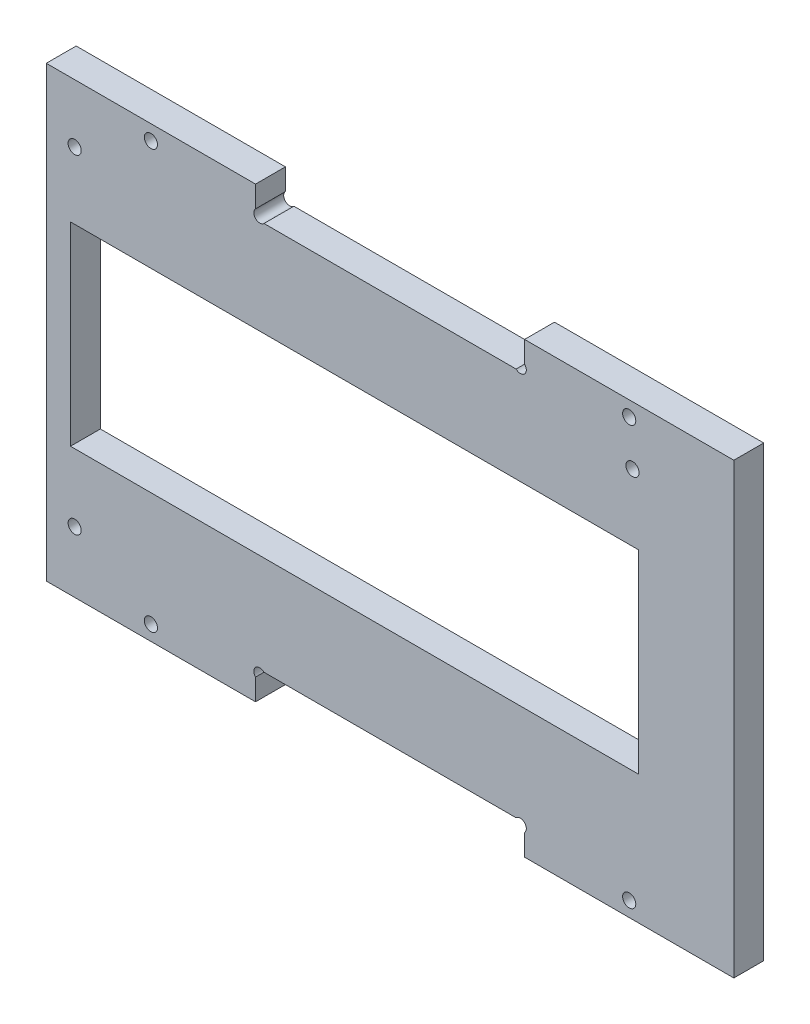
ISO-10303-21;
HEADER;
FILE_DESCRIPTION(('STEP AP214'),'2;1');
FILE_NAME('part.step','',(''),(''),'','','');
FILE_SCHEMA(('AUTOMOTIVE_DESIGN { 1 0 10303 214 1 1 1 1 }'));
ENDSEC;
DATA;
#1=APPLICATION_CONTEXT('core data for automotive mechanical design processes');
#2=APPLICATION_PROTOCOL_DEFINITION('international standard','automotive_design',2000,#1);
#3=PRODUCT_CONTEXT('',#1,'mechanical');
#4=PRODUCT('Part','Part','',(#3));
#5=PRODUCT_RELATED_PRODUCT_CATEGORY('part','',(#4));
#6=PRODUCT_DEFINITION_FORMATION('','',#4);
#7=PRODUCT_DEFINITION_CONTEXT('part definition',#1,'design');
#8=PRODUCT_DEFINITION('design','',#6,#7);
#9=PRODUCT_DEFINITION_SHAPE('','',#8);
#10=(LENGTH_UNIT() NAMED_UNIT(*) SI_UNIT(.MILLI.,.METRE.));
#11=(NAMED_UNIT(*) PLANE_ANGLE_UNIT() SI_UNIT($,.RADIAN.));
#12=(NAMED_UNIT(*) SI_UNIT($,.STERADIAN.) SOLID_ANGLE_UNIT());
#13=UNCERTAINTY_MEASURE_WITH_UNIT(LENGTH_MEASURE(1.E-05),#10,'distance_accuracy_value','');
#14=(GEOMETRIC_REPRESENTATION_CONTEXT(3) GLOBAL_UNCERTAINTY_ASSIGNED_CONTEXT((#13)) GLOBAL_UNIT_ASSIGNED_CONTEXT((#10,
#11,#12)) REPRESENTATION_CONTEXT('',''));
#15=CARTESIAN_POINT('',(0.,0.,0.));
#16=DIRECTION('',(0.,0.,1.));
#17=DIRECTION('',(1.,0.,0.));
#18=AXIS2_PLACEMENT_3D('',#15,#16,#17);
#19=CARTESIAN_POINT('',(0.,75.,5.));
#20=DIRECTION('',(0.,0.,-1.));
#21=DIRECTION('',(-1.,0.,0.));
#22=AXIS2_PLACEMENT_3D('',#19,#20,#21);
#23=PLANE('',#22);
#24=CARTESIAN_POINT('',(17.5,72.5,5.));
#25=DIRECTION('',(0.,0.,-1.));
#26=DIRECTION('',(-1.,0.,0.));
#27=AXIS2_PLACEMENT_3D('',#24,#25,#26);
#28=CIRCLE('',#27,1.10000000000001);
#29=CARTESIAN_POINT('',(16.4,72.5,5.));
#30=VERTEX_POINT('',#29);
#31=EDGE_CURVE('E771',#30,#30,#28,.T.);
#32=ORIENTED_EDGE('',*,*,#31,.T.);
#33=EDGE_LOOP('',(#32));
#34=FACE_BOUND('',#33,.T.);
#35=CARTESIAN_POINT('',(97.5,72.5,5.));
#36=DIRECTION('',(0.,0.,1.));
#37=DIRECTION('',(1.,0.,0.));
#38=AXIS2_PLACEMENT_3D('',#35,#36,#37);
#39=CIRCLE('',#38,1.10000000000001);
#40=CARTESIAN_POINT('',(98.6,72.5,5.));
#41=VERTEX_POINT('',#40);
#42=EDGE_CURVE('E227',#41,#41,#39,.T.);
#43=ORIENTED_EDGE('',*,*,#42,.F.);
#44=EDGE_LOOP('',(#43));
#45=FACE_BOUND('',#44,.T.);
#46=CARTESIAN_POINT('',(4.75,10.25,5.));
#47=DIRECTION('',(0.,0.,1.));
#48=DIRECTION('',(1.,0.,0.));
#49=AXIS2_PLACEMENT_3D('',#46,#47,#48);
#50=CIRCLE('',#49,1.1);
#51=CARTESIAN_POINT('',(5.85,10.25,5.));
#52=VERTEX_POINT('',#51);
#53=EDGE_CURVE('E314',#52,#52,#50,.T.);
#54=ORIENTED_EDGE('',*,*,#53,.F.);
#55=EDGE_LOOP('',(#54));
#56=FACE_BOUND('',#55,.T.);
#57=CARTESIAN_POINT('',(98.05,65.25,5.));
#58=DIRECTION('',(0.,0.,1.));
#59=DIRECTION('',(1.,0.,0.));
#60=AXIS2_PLACEMENT_3D('',#57,#58,#59);
#61=CIRCLE('',#60,1.10000000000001);
#62=CARTESIAN_POINT('',(99.15,65.25,5.));
#63=VERTEX_POINT('',#62);
#64=EDGE_CURVE('E320',#63,#63,#61,.T.);
#65=ORIENTED_EDGE('',*,*,#64,.F.);
#66=EDGE_LOOP('',(#65));
#67=FACE_BOUND('',#66,.T.);
#68=CARTESIAN_POINT('',(4.75,65.25,5.));
#69=DIRECTION('',(0.,0.,1.));
#70=DIRECTION('',(1.,0.,0.));
#71=AXIS2_PLACEMENT_3D('',#68,#69,#70);
#72=CIRCLE('',#71,1.1);
#73=CARTESIAN_POINT('',(5.85,65.25,5.));
#74=VERTEX_POINT('',#73);
#75=EDGE_CURVE('E326',#74,#74,#72,.T.);
#76=ORIENTED_EDGE('',*,*,#75,.F.);
#77=EDGE_LOOP('',(#76));
#78=FACE_BOUND('',#77,.T.);
#79=DIRECTION('',(1.,0.,0.));
#80=VECTOR('',#79,1.);
#81=CARTESIAN_POINT('',(4.05,21.55,5.));
#82=LINE('',#81,#80);
#83=CARTESIAN_POINT('',(4.05,21.55,5.));
#84=VERTEX_POINT('',#83);
#85=CARTESIAN_POINT('',(99.05,21.55,5.));
#86=VERTEX_POINT('',#85);
#87=EDGE_CURVE('E342',#84,#86,#82,.T.);
#88=ORIENTED_EDGE('',*,*,#87,.F.);
#89=DIRECTION('',(0.,-1.,0.));
#90=VECTOR('',#89,1.);
#91=CARTESIAN_POINT('',(4.05,21.55,5.));
#92=LINE('',#91,#90);
#93=CARTESIAN_POINT('',(4.05,54.05,5.));
#94=VERTEX_POINT('',#93);
#95=EDGE_CURVE('E340',#94,#84,#92,.T.);
#96=ORIENTED_EDGE('',*,*,#95,.F.);
#97=DIRECTION('',(-1.,0.,0.));
#98=VECTOR('',#97,1.);
#99=CARTESIAN_POINT('',(4.05,54.05,5.));
#100=LINE('',#99,#98);
#101=CARTESIAN_POINT('',(99.05,54.05,5.));
#102=VERTEX_POINT('',#101);
#103=EDGE_CURVE('E348',#102,#94,#100,.T.);
#104=ORIENTED_EDGE('',*,*,#103,.F.);
#105=DIRECTION('',(0.,1.,0.));
#106=VECTOR('',#105,1.);
#107=CARTESIAN_POINT('',(99.05,21.55,5.));
#108=LINE('',#107,#106);
#109=EDGE_CURVE('E345',#86,#102,#108,.T.);
#110=ORIENTED_EDGE('',*,*,#109,.F.);
#111=EDGE_LOOP('',(#88,#96,#104,#110));
#112=FACE_BOUND('',#111,.T.);
#113=CARTESIAN_POINT('',(79.2928932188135,4.29289321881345,5.));
#114=DIRECTION('',(0.,0.,1.));
#115=DIRECTION('',(1.,0.,0.));
#116=AXIS2_PLACEMENT_3D('',#113,#114,#115);
#117=CIRCLE('',#116,0.999999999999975);
#118=CARTESIAN_POINT('',(80.,3.58578643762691,5.));
#119=VERTEX_POINT('',#118);
#120=CARTESIAN_POINT('',(78.585786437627,5.,5.));
#121=VERTEX_POINT('',#120);
#122=EDGE_CURVE('E250',#119,#121,#117,.T.);
#123=ORIENTED_EDGE('',*,*,#122,.F.);
#124=DIRECTION('',(0.,1.,0.));
#125=VECTOR('',#124,1.);
#126=CARTESIAN_POINT('',(80.,0.,5.));
#127=LINE('',#126,#125);
#128=CARTESIAN_POINT('',(80.,0.,5.));
#129=VERTEX_POINT('',#128);
#130=EDGE_CURVE('E279',#129,#119,#127,.T.);
#131=ORIENTED_EDGE('',*,*,#130,.F.);
#132=DIRECTION('',(1.,0.,0.));
#133=VECTOR('',#132,1.);
#134=CARTESIAN_POINT('',(0.,0.,5.));
#135=LINE('',#134,#133);
#136=CARTESIAN_POINT('',(115.,0.,5.));
#137=VERTEX_POINT('',#136);
#138=EDGE_CURVE('E367',#129,#137,#135,.T.);
#139=ORIENTED_EDGE('',*,*,#138,.T.);
#140=DIRECTION('',(0.,1.,0.));
#141=VECTOR('',#140,1.);
#142=CARTESIAN_POINT('',(115.,0.,5.));
#143=LINE('',#142,#141);
#144=CARTESIAN_POINT('',(115.,75.,5.));
#145=VERTEX_POINT('',#144);
#146=EDGE_CURVE('E372',#137,#145,#143,.T.);
#147=ORIENTED_EDGE('',*,*,#146,.T.);
#148=DIRECTION('',(-1.,0.,0.));
#149=VECTOR('',#148,1.);
#150=CARTESIAN_POINT('',(0.,75.,5.));
#151=LINE('',#150,#149);
#152=CARTESIAN_POINT('',(80.,75.,5.));
#153=VERTEX_POINT('',#152);
#154=EDGE_CURVE('E375',#145,#153,#151,.T.);
#155=ORIENTED_EDGE('',*,*,#154,.T.);
#156=DIRECTION('',(0.,1.,0.));
#157=VECTOR('',#156,1.);
#158=CARTESIAN_POINT('',(80.,75.,5.));
#159=LINE('',#158,#157);
#160=CARTESIAN_POINT('',(80.,71.4142135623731,5.));
#161=VERTEX_POINT('',#160);
#162=EDGE_CURVE('E303',#161,#153,#159,.T.);
#163=ORIENTED_EDGE('',*,*,#162,.F.);
#164=CARTESIAN_POINT('',(79.2928932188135,70.7071067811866,5.));
#165=DIRECTION('',(0.,0.,1.));
#166=DIRECTION('',(1.,0.,0.));
#167=AXIS2_PLACEMENT_3D('',#164,#165,#166);
#168=CIRCLE('',#167,0.999999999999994);
#169=CARTESIAN_POINT('',(78.5857864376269,70.,5.));
#170=VERTEX_POINT('',#169);
#171=EDGE_CURVE('E263',#170,#161,#168,.T.);
#172=ORIENTED_EDGE('',*,*,#171,.F.);
#173=DIRECTION('',(1.,0.,0.));
#174=VECTOR('',#173,1.);
#175=CARTESIAN_POINT('',(35.,70.,5.));
#176=LINE('',#175,#174);
#177=CARTESIAN_POINT('',(36.4142135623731,70.,5.));
#178=VERTEX_POINT('',#177);
#179=EDGE_CURVE('E300',#178,#170,#176,.T.);
#180=ORIENTED_EDGE('',*,*,#179,.F.);
#181=CARTESIAN_POINT('',(35.7071067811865,70.7071067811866,5.));
#182=DIRECTION('',(0.,0.,1.));
#183=DIRECTION('',(1.,0.,0.));
#184=AXIS2_PLACEMENT_3D('',#181,#182,#183);
#185=CIRCLE('',#184,0.999999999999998);
#186=CARTESIAN_POINT('',(35.,71.4142135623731,5.));
#187=VERTEX_POINT('',#186);
#188=EDGE_CURVE('E269',#187,#178,#185,.T.);
#189=ORIENTED_EDGE('',*,*,#188,.F.);
#190=DIRECTION('',(0.,-1.,0.));
#191=VECTOR('',#190,1.);
#192=CARTESIAN_POINT('',(35.,75.,5.));
#193=LINE('',#192,#191);
#194=CARTESIAN_POINT('',(35.,75.,5.));
#195=VERTEX_POINT('',#194);
#196=EDGE_CURVE('E297',#195,#187,#193,.T.);
#197=ORIENTED_EDGE('',*,*,#196,.F.);
#198=CARTESIAN_POINT('',(0.,75.,5.));
#199=VERTEX_POINT('',#198);
#200=EDGE_CURVE('E374',#195,#199,#151,.T.);
#201=ORIENTED_EDGE('',*,*,#200,.T.);
#202=DIRECTION('',(0.,-1.,0.));
#203=VECTOR('',#202,1.);
#204=CARTESIAN_POINT('',(0.,0.,5.));
#205=LINE('',#204,#203);
#206=CARTESIAN_POINT('',(0.,0.,5.));
#207=VERTEX_POINT('',#206);
#208=EDGE_CURVE('E364',#199,#207,#205,.T.);
#209=ORIENTED_EDGE('',*,*,#208,.T.);
#210=CARTESIAN_POINT('',(35.,0.,5.));
#211=VERTEX_POINT('',#210);
#212=EDGE_CURVE('E369',#207,#211,#135,.T.);
#213=ORIENTED_EDGE('',*,*,#212,.T.);
#214=DIRECTION('',(0.,-1.,0.));
#215=VECTOR('',#214,1.);
#216=CARTESIAN_POINT('',(35.,0.,5.));
#217=LINE('',#216,#215);
#218=CARTESIAN_POINT('',(35.,3.58578643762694,5.));
#219=VERTEX_POINT('',#218);
#220=EDGE_CURVE('E284',#219,#211,#217,.T.);
#221=ORIENTED_EDGE('',*,*,#220,.F.);
#222=CARTESIAN_POINT('',(35.7071067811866,4.29289321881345,5.));
#223=DIRECTION('',(0.,0.,1.));
#224=DIRECTION('',(1.,0.,0.));
#225=AXIS2_PLACEMENT_3D('',#222,#223,#224);
#226=CIRCLE('',#225,0.99999999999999);
#227=CARTESIAN_POINT('',(36.4142135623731,5.,5.));
#228=VERTEX_POINT('',#227);
#229=EDGE_CURVE('E257',#228,#219,#226,.T.);
#230=ORIENTED_EDGE('',*,*,#229,.F.);
#231=DIRECTION('',(-1.,0.,0.));
#232=VECTOR('',#231,1.);
#233=CARTESIAN_POINT('',(80.,5.,5.));
#234=LINE('',#233,#232);
#235=EDGE_CURVE('E282',#121,#228,#234,.T.);
#236=ORIENTED_EDGE('',*,*,#235,.F.);
#237=EDGE_LOOP('',(#123,#131,#139,#147,#155,#163,#172,#180,#189,#197,#201,#209,#213,#221,#230,#236));
#238=FACE_BOUND('',#237,.T.);
#239=CARTESIAN_POINT('',(17.5,2.5,5.));
#240=DIRECTION('',(0.,0.,1.));
#241=DIRECTION('',(-1.,0.,0.));
#242=AXIS2_PLACEMENT_3D('',#239,#240,#241);
#243=CIRCLE('',#242,1.10000000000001);
#244=CARTESIAN_POINT('',(16.4,2.5,5.));
#245=VERTEX_POINT('',#244);
#246=EDGE_CURVE('E768',#245,#245,#243,.T.);
#247=ORIENTED_EDGE('',*,*,#246,.F.);
#248=EDGE_LOOP('',(#247));
#249=FACE_BOUND('',#248,.T.);
#250=CARTESIAN_POINT('',(97.5,2.5,5.));
#251=DIRECTION('',(0.,0.,-1.));
#252=DIRECTION('',(1.,0.,0.));
#253=AXIS2_PLACEMENT_3D('',#250,#251,#252);
#254=CIRCLE('',#253,1.10000000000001);
#255=CARTESIAN_POINT('',(98.6,2.5,5.));
#256=VERTEX_POINT('',#255);
#257=EDGE_CURVE('E762',#256,#256,#254,.T.);
#258=ORIENTED_EDGE('',*,*,#257,.T.);
#259=EDGE_LOOP('',(#258));
#260=FACE_BOUND('',#259,.T.);
#261=ADVANCED_FACE('F32',(#34,#45,#56,#67,#78,#112,#238,#249,#260),#23,.F.);
#262=CARTESIAN_POINT('',(0.,75.,0.));
#263=DIRECTION('',(0.,0.,-1.));
#264=DIRECTION('',(-1.,0.,0.));
#265=AXIS2_PLACEMENT_3D('',#262,#263,#264);
#266=PLANE('',#265);
#267=CARTESIAN_POINT('',(17.5,72.5,0.));
#268=DIRECTION('',(0.,0.,-1.));
#269=DIRECTION('',(-1.,0.,0.));
#270=AXIS2_PLACEMENT_3D('',#267,#268,#269);
#271=CIRCLE('',#270,1.10000000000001);
#272=CARTESIAN_POINT('',(16.4,72.5,0.));
#273=VERTEX_POINT('',#272);
#274=EDGE_CURVE('E775',#273,#273,#271,.T.);
#275=ORIENTED_EDGE('',*,*,#274,.F.);
#276=EDGE_LOOP('',(#275));
#277=FACE_BOUND('',#276,.T.);
#278=CARTESIAN_POINT('',(97.5,72.5,0.));
#279=DIRECTION('',(0.,0.,-1.));
#280=DIRECTION('',(-1.,0.,0.));
#281=AXIS2_PLACEMENT_3D('',#278,#279,#280);
#282=CIRCLE('',#281,1.10000000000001);
#283=CARTESIAN_POINT('',(96.4,72.5,0.));
#284=VERTEX_POINT('',#283);
#285=EDGE_CURVE('E220',#284,#284,#282,.F.);
#286=ORIENTED_EDGE('',*,*,#285,.T.);
#287=EDGE_LOOP('',(#286));
#288=FACE_BOUND('',#287,.T.);
#289=DIRECTION('',(0.,-1.,0.));
#290=VECTOR('',#289,1.);
#291=CARTESIAN_POINT('',(93.05,13.5,0.));
#292=LINE('',#291,#290);
#293=CARTESIAN_POINT('',(93.05,13.5,0.));
#294=VERTEX_POINT('',#293);
#295=CARTESIAN_POINT('',(93.05,7.49999999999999,0.));
#296=VERTEX_POINT('',#295);
#297=EDGE_CURVE('E47',#294,#296,#292,.T.);
#298=ORIENTED_EDGE('',*,*,#297,.F.);
#299=DIRECTION('',(1.,0.,0.));
#300=VECTOR('',#299,1.);
#301=CARTESIAN_POINT('',(93.05,13.5,0.));
#302=LINE('',#301,#300);
#303=CARTESIAN_POINT('',(53.05,13.5,0.));
#304=VERTEX_POINT('',#303);
#305=EDGE_CURVE('E214',#304,#294,#302,.T.);
#306=ORIENTED_EDGE('',*,*,#305,.F.);
#307=DIRECTION('',(0.,1.,0.));
#308=VECTOR('',#307,1.);
#309=CARTESIAN_POINT('',(53.05,13.5,0.));
#310=LINE('',#309,#308);
#311=CARTESIAN_POINT('',(53.05,7.5,0.));
#312=VERTEX_POINT('',#311);
#313=EDGE_CURVE('E217',#312,#304,#310,.T.);
#314=ORIENTED_EDGE('',*,*,#313,.F.);
#315=DIRECTION('',(-1.,0.,0.));
#316=VECTOR('',#315,1.);
#317=CARTESIAN_POINT('',(93.05,7.5,0.));
#318=LINE('',#317,#316);
#319=EDGE_CURVE('E226',#296,#312,#318,.T.);
#320=ORIENTED_EDGE('',*,*,#319,.F.);
#321=EDGE_LOOP('',(#298,#306,#314,#320));
#322=FACE_BOUND('',#321,.T.);
#323=DIRECTION('',(0.,1.,0.));
#324=VECTOR('',#323,1.);
#325=CARTESIAN_POINT('',(80.,0.,0.));
#326=LINE('',#325,#324);
#327=CARTESIAN_POINT('',(80.,0.,0.));
#328=VERTEX_POINT('',#327);
#329=CARTESIAN_POINT('',(80.,3.58578643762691,0.));
#330=VERTEX_POINT('',#329);
#331=EDGE_CURVE('E276',#328,#330,#326,.T.);
#332=ORIENTED_EDGE('',*,*,#331,.T.);
#333=CARTESIAN_POINT('',(79.2928932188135,4.29289321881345,0.));
#334=DIRECTION('',(0.,0.,-1.));
#335=DIRECTION('',(-1.,0.,0.));
#336=AXIS2_PLACEMENT_3D('',#333,#334,#335);
#337=CIRCLE('',#336,0.999999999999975);
#338=CARTESIAN_POINT('',(78.585786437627,5.,0.));
#339=VERTEX_POINT('',#338);
#340=EDGE_CURVE('E252',#330,#339,#337,.F.);
#341=ORIENTED_EDGE('',*,*,#340,.T.);
#342=DIRECTION('',(-1.,0.,0.));
#343=VECTOR('',#342,1.);
#344=CARTESIAN_POINT('',(80.,5.,0.));
#345=LINE('',#344,#343);
#346=CARTESIAN_POINT('',(36.4142135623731,5.,0.));
#347=VERTEX_POINT('',#346);
#348=EDGE_CURVE('E55',#339,#347,#345,.T.);
#349=ORIENTED_EDGE('',*,*,#348,.T.);
#350=CARTESIAN_POINT('',(35.7071067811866,4.29289321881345,0.));
#351=DIRECTION('',(0.,0.,-1.));
#352=DIRECTION('',(-1.,0.,0.));
#353=AXIS2_PLACEMENT_3D('',#350,#351,#352);
#354=CIRCLE('',#353,0.99999999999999);
#355=CARTESIAN_POINT('',(35.,3.58578643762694,0.));
#356=VERTEX_POINT('',#355);
#357=EDGE_CURVE('E259',#347,#356,#354,.F.);
#358=ORIENTED_EDGE('',*,*,#357,.T.);
#359=DIRECTION('',(0.,-1.,0.));
#360=VECTOR('',#359,1.);
#361=CARTESIAN_POINT('',(35.,0.,0.));
#362=LINE('',#361,#360);
#363=CARTESIAN_POINT('',(35.,0.,0.));
#364=VERTEX_POINT('',#363);
#365=EDGE_CURVE('E274',#356,#364,#362,.T.);
#366=ORIENTED_EDGE('',*,*,#365,.T.);
#367=DIRECTION('',(1.,0.,0.));
#368=VECTOR('',#367,1.);
#369=CARTESIAN_POINT('',(0.,0.,0.));
#370=LINE('',#369,#368);
#371=CARTESIAN_POINT('',(0.,0.,0.));
#372=VERTEX_POINT('',#371);
#373=EDGE_CURVE('E382',#372,#364,#370,.T.);
#374=ORIENTED_EDGE('',*,*,#373,.F.);
#375=DIRECTION('',(0.,-1.,0.));
#376=VECTOR('',#375,1.);
#377=CARTESIAN_POINT('',(0.,0.,0.));
#378=LINE('',#377,#376);
#379=CARTESIAN_POINT('',(0.,75.,0.));
#380=VERTEX_POINT('',#379);
#381=EDGE_CURVE('E363',#380,#372,#378,.T.);
#382=ORIENTED_EDGE('',*,*,#381,.F.);
#383=DIRECTION('',(-1.,0.,0.));
#384=VECTOR('',#383,1.);
#385=CARTESIAN_POINT('',(0.,75.,0.));
#386=LINE('',#385,#384);
#387=CARTESIAN_POINT('',(35.,75.,0.));
#388=VERTEX_POINT('',#387);
#389=EDGE_CURVE('E387',#388,#380,#386,.T.);
#390=ORIENTED_EDGE('',*,*,#389,.F.);
#391=DIRECTION('',(0.,-1.,0.));
#392=VECTOR('',#391,1.);
#393=CARTESIAN_POINT('',(35.,75.,0.));
#394=LINE('',#393,#392);
#395=CARTESIAN_POINT('',(35.,71.4142135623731,0.));
#396=VERTEX_POINT('',#395);
#397=EDGE_CURVE('E294',#388,#396,#394,.T.);
#398=ORIENTED_EDGE('',*,*,#397,.T.);
#399=CARTESIAN_POINT('',(35.7071067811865,70.7071067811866,0.));
#400=DIRECTION('',(0.,0.,-1.));
#401=DIRECTION('',(-1.,0.,0.));
#402=AXIS2_PLACEMENT_3D('',#399,#400,#401);
#403=CIRCLE('',#402,0.999999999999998);
#404=CARTESIAN_POINT('',(36.4142135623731,70.,0.));
#405=VERTEX_POINT('',#404);
#406=EDGE_CURVE('E271',#396,#405,#403,.F.);
#407=ORIENTED_EDGE('',*,*,#406,.T.);
#408=DIRECTION('',(1.,0.,0.));
#409=VECTOR('',#408,1.);
#410=CARTESIAN_POINT('',(35.,70.,0.));
#411=LINE('',#410,#409);
#412=CARTESIAN_POINT('',(78.5857864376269,70.,0.));
#413=VERTEX_POINT('',#412);
#414=EDGE_CURVE('E308',#405,#413,#411,.T.);
#415=ORIENTED_EDGE('',*,*,#414,.T.);
#416=CARTESIAN_POINT('',(79.2928932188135,70.7071067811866,0.));
#417=DIRECTION('',(0.,0.,-1.));
#418=DIRECTION('',(-1.,0.,0.));
#419=AXIS2_PLACEMENT_3D('',#416,#417,#418);
#420=CIRCLE('',#419,0.999999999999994);
#421=CARTESIAN_POINT('',(80.,71.4142135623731,0.));
#422=VERTEX_POINT('',#421);
#423=EDGE_CURVE('E265',#413,#422,#420,.F.);
#424=ORIENTED_EDGE('',*,*,#423,.T.);
#425=DIRECTION('',(0.,1.,0.));
#426=VECTOR('',#425,1.);
#427=CARTESIAN_POINT('',(80.,75.,0.));
#428=LINE('',#427,#426);
#429=CARTESIAN_POINT('',(80.,75.,0.));
#430=VERTEX_POINT('',#429);
#431=EDGE_CURVE('E292',#422,#430,#428,.T.);
#432=ORIENTED_EDGE('',*,*,#431,.T.);
#433=CARTESIAN_POINT('',(115.,75.,0.));
#434=VERTEX_POINT('',#433);
#435=EDGE_CURVE('E368',#434,#430,#386,.T.);
#436=ORIENTED_EDGE('',*,*,#435,.F.);
#437=DIRECTION('',(0.,1.,0.));
#438=VECTOR('',#437,1.);
#439=CARTESIAN_POINT('',(115.,0.,0.));
#440=LINE('',#439,#438);
#441=CARTESIAN_POINT('',(115.,0.,0.));
#442=VERTEX_POINT('',#441);
#443=EDGE_CURVE('E385',#442,#434,#440,.T.);
#444=ORIENTED_EDGE('',*,*,#443,.F.);
#445=EDGE_CURVE('E381',#328,#442,#370,.T.);
#446=ORIENTED_EDGE('',*,*,#445,.F.);
#447=EDGE_LOOP('',(#332,#341,#349,#358,#366,#374,#382,#390,#398,#407,#415,#424,#432,#436,#444,#446));
#448=FACE_BOUND('',#447,.T.);
#449=CARTESIAN_POINT('',(4.75,10.25,0.));
#450=DIRECTION('',(0.,0.,-1.));
#451=DIRECTION('',(-1.,0.,0.));
#452=AXIS2_PLACEMENT_3D('',#449,#450,#451);
#453=CIRCLE('',#452,1.1);
#454=CARTESIAN_POINT('',(3.65,10.25,0.));
#455=VERTEX_POINT('',#454);
#456=EDGE_CURVE('E313',#455,#455,#453,.F.);
#457=ORIENTED_EDGE('',*,*,#456,.T.);
#458=EDGE_LOOP('',(#457));
#459=FACE_BOUND('',#458,.T.);
#460=CARTESIAN_POINT('',(98.05,65.25,0.));
#461=DIRECTION('',(0.,0.,-1.));
#462=DIRECTION('',(-1.,0.,0.));
#463=AXIS2_PLACEMENT_3D('',#460,#461,#462);
#464=CIRCLE('',#463,1.10000000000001);
#465=CARTESIAN_POINT('',(96.95,65.25,0.));
#466=VERTEX_POINT('',#465);
#467=EDGE_CURVE('E317',#466,#466,#464,.F.);
#468=ORIENTED_EDGE('',*,*,#467,.T.);
#469=EDGE_LOOP('',(#468));
#470=FACE_BOUND('',#469,.T.);
#471=CARTESIAN_POINT('',(4.75,65.25,0.));
#472=DIRECTION('',(0.,0.,-1.));
#473=DIRECTION('',(-1.,0.,0.));
#474=AXIS2_PLACEMENT_3D('',#471,#472,#473);
#475=CIRCLE('',#474,1.1);
#476=CARTESIAN_POINT('',(3.65,65.25,0.));
#477=VERTEX_POINT('',#476);
#478=EDGE_CURVE('E323',#477,#477,#475,.F.);
#479=ORIENTED_EDGE('',*,*,#478,.T.);
#480=EDGE_LOOP('',(#479));
#481=FACE_BOUND('',#480,.T.);
#482=DIRECTION('',(0.,-1.,0.));
#483=VECTOR('',#482,1.);
#484=CARTESIAN_POINT('',(4.05,21.55,0.));
#485=LINE('',#484,#483);
#486=CARTESIAN_POINT('',(4.05,54.05,0.));
#487=VERTEX_POINT('',#486);
#488=CARTESIAN_POINT('',(4.05,21.55,0.));
#489=VERTEX_POINT('',#488);
#490=EDGE_CURVE('E337',#487,#489,#485,.T.);
#491=ORIENTED_EDGE('',*,*,#490,.T.);
#492=DIRECTION('',(1.,0.,0.));
#493=VECTOR('',#492,1.);
#494=CARTESIAN_POINT('',(4.05,21.55,0.));
#495=LINE('',#494,#493);
#496=CARTESIAN_POINT('',(99.05,21.55,0.));
#497=VERTEX_POINT('',#496);
#498=EDGE_CURVE('E354',#489,#497,#495,.T.);
#499=ORIENTED_EDGE('',*,*,#498,.T.);
#500=DIRECTION('',(0.,1.,0.));
#501=VECTOR('',#500,1.);
#502=CARTESIAN_POINT('',(99.05,21.55,0.));
#503=LINE('',#502,#501);
#504=CARTESIAN_POINT('',(99.05,54.05,0.));
#505=VERTEX_POINT('',#504);
#506=EDGE_CURVE('E329',#497,#505,#503,.T.);
#507=ORIENTED_EDGE('',*,*,#506,.T.);
#508=DIRECTION('',(-1.,0.,0.));
#509=VECTOR('',#508,1.);
#510=CARTESIAN_POINT('',(4.05,54.05,0.));
#511=LINE('',#510,#509);
#512=EDGE_CURVE('E334',#505,#487,#511,.T.);
#513=ORIENTED_EDGE('',*,*,#512,.T.);
#514=EDGE_LOOP('',(#491,#499,#507,#513));
#515=FACE_BOUND('',#514,.T.);
#516=CARTESIAN_POINT('',(17.5,2.5,0.));
#517=DIRECTION('',(0.,0.,-1.));
#518=DIRECTION('',(-1.,0.,0.));
#519=AXIS2_PLACEMENT_3D('',#516,#517,#518);
#520=CIRCLE('',#519,1.10000000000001);
#521=CARTESIAN_POINT('',(16.4,2.5,0.));
#522=VERTEX_POINT('',#521);
#523=EDGE_CURVE('E765',#522,#522,#520,.F.);
#524=ORIENTED_EDGE('',*,*,#523,.T.);
#525=EDGE_LOOP('',(#524));
#526=FACE_BOUND('',#525,.T.);
#527=CARTESIAN_POINT('',(97.5,2.5,0.));
#528=DIRECTION('',(0.,0.,-1.));
#529=DIRECTION('',(-1.,0.,0.));
#530=AXIS2_PLACEMENT_3D('',#527,#528,#529);
#531=CIRCLE('',#530,1.10000000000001);
#532=CARTESIAN_POINT('',(96.4,2.5,0.));
#533=VERTEX_POINT('',#532);
#534=EDGE_CURVE('E759',#533,#533,#531,.T.);
#535=ORIENTED_EDGE('',*,*,#534,.F.);
#536=EDGE_LOOP('',(#535));
#537=FACE_BOUND('',#536,.T.);
#538=ADVANCED_FACE('F405',(#277,#288,#322,#448,#459,#470,#481,#515,#526,#537),#266,.T.);
#539=CARTESIAN_POINT('',(0.,0.,5.));
#540=DIRECTION('',(0.,1.,0.));
#541=DIRECTION('',(0.,0.,1.));
#542=AXIS2_PLACEMENT_3D('',#539,#540,#541);
#543=PLANE('',#542);
#544=ORIENTED_EDGE('',*,*,#138,.F.);
#545=DIRECTION('',(0.,0.,1.));
#546=VECTOR('',#545,1.);
#547=CARTESIAN_POINT('',(80.,0.,-0.001000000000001));
#548=LINE('',#547,#546);
#549=EDGE_CURVE('E287',#328,#129,#548,.T.);
#550=ORIENTED_EDGE('',*,*,#549,.F.);
#551=ORIENTED_EDGE('',*,*,#445,.T.);
#552=DIRECTION('',(0.,0.,-1.));
#553=VECTOR('',#552,1.);
#554=CARTESIAN_POINT('',(115.,0.,5.));
#555=LINE('',#554,#553);
#556=EDGE_CURVE('E40',#137,#442,#555,.T.);
#557=ORIENTED_EDGE('',*,*,#556,.F.);
#558=EDGE_LOOP('',(#544,#550,#551,#557));
#559=FACE_BOUND('',#558,.T.);
#560=ADVANCED_FACE('F418',(#559),#543,.F.);
#561=CARTESIAN_POINT('',(0.,75.,5.));
#562=DIRECTION('',(0.,-1.,0.));
#563=DIRECTION('',(0.,0.,-1.));
#564=AXIS2_PLACEMENT_3D('',#561,#562,#563);
#565=PLANE('',#564);
#566=ORIENTED_EDGE('',*,*,#200,.F.);
#567=DIRECTION('',(0.,0.,1.));
#568=VECTOR('',#567,1.);
#569=CARTESIAN_POINT('',(35.,75.,-0.001000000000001));
#570=LINE('',#569,#568);
#571=EDGE_CURVE('E306',#388,#195,#570,.T.);
#572=ORIENTED_EDGE('',*,*,#571,.F.);
#573=ORIENTED_EDGE('',*,*,#389,.T.);
#574=DIRECTION('',(0.,0.,-1.));
#575=VECTOR('',#574,1.);
#576=CARTESIAN_POINT('',(0.,75.,5.));
#577=LINE('',#576,#575);
#578=EDGE_CURVE('E378',#199,#380,#577,.T.);
#579=ORIENTED_EDGE('',*,*,#578,.F.);
#580=EDGE_LOOP('',(#566,#572,#573,#579));
#581=FACE_BOUND('',#580,.T.);
#582=ADVANCED_FACE('F447',(#581),#565,.F.);
#583=CARTESIAN_POINT('',(0.,0.,5.));
#584=DIRECTION('',(1.,0.,0.));
#585=DIRECTION('',(0.,0.,-1.));
#586=AXIS2_PLACEMENT_3D('',#583,#584,#585);
#587=PLANE('',#586);
#588=ORIENTED_EDGE('',*,*,#381,.T.);
#589=DIRECTION('',(0.,0.,-1.));
#590=VECTOR('',#589,1.);
#591=CARTESIAN_POINT('',(0.,0.,5.));
#592=LINE('',#591,#590);
#593=EDGE_CURVE('E11',#207,#372,#592,.T.);
#594=ORIENTED_EDGE('',*,*,#593,.F.);
#595=ORIENTED_EDGE('',*,*,#208,.F.);
#596=ORIENTED_EDGE('',*,*,#578,.T.);
#597=EDGE_LOOP('',(#588,#594,#595,#596));
#598=FACE_BOUND('',#597,.T.);
#599=ADVANCED_FACE('F34',(#598),#587,.F.);
#600=ORIENTED_EDGE('',*,*,#373,.T.);
#601=DIRECTION('',(0.,0.,1.));
#602=VECTOR('',#601,1.);
#603=CARTESIAN_POINT('',(35.,0.,-0.001000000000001));
#604=LINE('',#603,#602);
#605=EDGE_CURVE('E286',#364,#211,#604,.T.);
#606=ORIENTED_EDGE('',*,*,#605,.T.);
#607=ORIENTED_EDGE('',*,*,#212,.F.);
#608=ORIENTED_EDGE('',*,*,#593,.T.);
#609=EDGE_LOOP('',(#600,#606,#607,#608));
#610=FACE_BOUND('',#609,.T.);
#611=ADVANCED_FACE('F438',(#610),#543,.F.);
#612=CARTESIAN_POINT('',(115.,0.,5.));
#613=DIRECTION('',(-1.,0.,0.));
#614=DIRECTION('',(0.,0.,1.));
#615=AXIS2_PLACEMENT_3D('',#612,#613,#614);
#616=PLANE('',#615);
#617=ORIENTED_EDGE('',*,*,#443,.T.);
#618=DIRECTION('',(0.,0.,-1.));
#619=VECTOR('',#618,1.);
#620=CARTESIAN_POINT('',(115.,75.,5.));
#621=LINE('',#620,#619);
#622=EDGE_CURVE('E392',#145,#434,#621,.T.);
#623=ORIENTED_EDGE('',*,*,#622,.F.);
#624=ORIENTED_EDGE('',*,*,#146,.F.);
#625=ORIENTED_EDGE('',*,*,#556,.T.);
#626=EDGE_LOOP('',(#617,#623,#624,#625));
#627=FACE_BOUND('',#626,.T.);
#628=ADVANCED_FACE('F399',(#627),#616,.F.);
#629=ORIENTED_EDGE('',*,*,#435,.T.);
#630=DIRECTION('',(0.,0.,1.));
#631=VECTOR('',#630,1.);
#632=CARTESIAN_POINT('',(80.,75.,-0.001000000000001));
#633=LINE('',#632,#631);
#634=EDGE_CURVE('E305',#430,#153,#633,.T.);
#635=ORIENTED_EDGE('',*,*,#634,.T.);
#636=ORIENTED_EDGE('',*,*,#154,.F.);
#637=ORIENTED_EDGE('',*,*,#622,.T.);
#638=EDGE_LOOP('',(#629,#635,#636,#637));
#639=FACE_BOUND('',#638,.T.);
#640=ADVANCED_FACE('F410',(#639),#565,.F.);
#641=CARTESIAN_POINT('',(4.05,21.55,-0.001000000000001));
#642=DIRECTION('',(-1.,0.,0.));
#643=DIRECTION('',(0.,0.,1.));
#644=AXIS2_PLACEMENT_3D('',#641,#642,#643);
#645=PLANE('',#644);
#646=DIRECTION('',(0.,0.,1.));
#647=VECTOR('',#646,1.);
#648=CARTESIAN_POINT('',(4.05,54.05,-0.001000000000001));
#649=LINE('',#648,#647);
#650=EDGE_CURVE('E352',#487,#94,#649,.T.);
#651=ORIENTED_EDGE('',*,*,#650,.T.);
#652=ORIENTED_EDGE('',*,*,#95,.T.);
#653=DIRECTION('',(0.,0.,1.));
#654=VECTOR('',#653,1.);
#655=CARTESIAN_POINT('',(4.05,21.55,-0.001000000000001));
#656=LINE('',#655,#654);
#657=EDGE_CURVE('E351',#489,#84,#656,.T.);
#658=ORIENTED_EDGE('',*,*,#657,.F.);
#659=ORIENTED_EDGE('',*,*,#490,.F.);
#660=EDGE_LOOP('',(#651,#652,#658,#659));
#661=FACE_BOUND('',#660,.T.);
#662=ADVANCED_FACE('F487',(#661),#645,.F.);
#663=CARTESIAN_POINT('',(4.05,54.05,-0.001000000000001));
#664=DIRECTION('',(0.,1.,0.));
#665=DIRECTION('',(0.,0.,1.));
#666=AXIS2_PLACEMENT_3D('',#663,#664,#665);
#667=PLANE('',#666);
#668=DIRECTION('',(0.,0.,1.));
#669=VECTOR('',#668,1.);
#670=CARTESIAN_POINT('',(99.05,54.05,-0.001000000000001));
#671=LINE('',#670,#669);
#672=EDGE_CURVE('E355',#505,#102,#671,.T.);
#673=ORIENTED_EDGE('',*,*,#672,.T.);
#674=ORIENTED_EDGE('',*,*,#103,.T.);
#675=ORIENTED_EDGE('',*,*,#650,.F.);
#676=ORIENTED_EDGE('',*,*,#512,.F.);
#677=EDGE_LOOP('',(#673,#674,#675,#676));
#678=FACE_BOUND('',#677,.T.);
#679=ADVANCED_FACE('F532',(#678),#667,.F.);
#680=CARTESIAN_POINT('',(99.05,21.55,-0.001000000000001));
#681=DIRECTION('',(1.,0.,0.));
#682=DIRECTION('',(0.,0.,-1.));
#683=AXIS2_PLACEMENT_3D('',#680,#681,#682);
#684=PLANE('',#683);
#685=DIRECTION('',(0.,0.,1.));
#686=VECTOR('',#685,1.);
#687=CARTESIAN_POINT('',(99.05,21.55,-0.001000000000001));
#688=LINE('',#687,#686);
#689=EDGE_CURVE('E357',#497,#86,#688,.T.);
#690=ORIENTED_EDGE('',*,*,#689,.T.);
#691=ORIENTED_EDGE('',*,*,#109,.T.);
#692=ORIENTED_EDGE('',*,*,#672,.F.);
#693=ORIENTED_EDGE('',*,*,#506,.F.);
#694=EDGE_LOOP('',(#690,#691,#692,#693));
#695=FACE_BOUND('',#694,.T.);
#696=ADVANCED_FACE('F541',(#695),#684,.F.);
#697=CARTESIAN_POINT('',(4.05,21.55,-0.001000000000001));
#698=DIRECTION('',(0.,-1.,0.));
#699=DIRECTION('',(0.,0.,-1.));
#700=AXIS2_PLACEMENT_3D('',#697,#698,#699);
#701=PLANE('',#700);
#702=ORIENTED_EDGE('',*,*,#657,.T.);
#703=ORIENTED_EDGE('',*,*,#87,.T.);
#704=ORIENTED_EDGE('',*,*,#689,.F.);
#705=ORIENTED_EDGE('',*,*,#498,.F.);
#706=EDGE_LOOP('',(#702,#703,#704,#705));
#707=FACE_BOUND('',#706,.T.);
#708=ADVANCED_FACE('F551',(#707),#701,.F.);
#709=CARTESIAN_POINT('',(4.75,65.25,-0.001000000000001));
#710=DIRECTION('',(0.,0.,1.));
#711=DIRECTION('',(1.,0.,0.));
#712=AXIS2_PLACEMENT_3D('',#709,#710,#711);
#713=CYLINDRICAL_SURFACE('',#712,1.1);
#714=ORIENTED_EDGE('',*,*,#478,.F.);
#715=EDGE_LOOP('',(#714));
#716=FACE_BOUND('',#715,.T.);
#717=ORIENTED_EDGE('',*,*,#75,.T.);
#718=EDGE_LOOP('',(#717));
#719=FACE_BOUND('',#718,.T.);
#720=ADVANCED_FACE('F561',(#716,#719),#713,.F.);
#721=CARTESIAN_POINT('',(98.05,65.25,-0.001000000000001));
#722=DIRECTION('',(0.,0.,1.));
#723=DIRECTION('',(1.,0.,0.));
#724=AXIS2_PLACEMENT_3D('',#721,#722,#723);
#725=CYLINDRICAL_SURFACE('',#724,1.10000000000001);
#726=ORIENTED_EDGE('',*,*,#467,.F.);
#727=EDGE_LOOP('',(#726));
#728=FACE_BOUND('',#727,.T.);
#729=ORIENTED_EDGE('',*,*,#64,.T.);
#730=EDGE_LOOP('',(#729));
#731=FACE_BOUND('',#730,.T.);
#732=ADVANCED_FACE('F570',(#728,#731),#725,.F.);
#733=CARTESIAN_POINT('',(4.75,10.25,-0.001000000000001));
#734=DIRECTION('',(0.,0.,1.));
#735=DIRECTION('',(1.,0.,0.));
#736=AXIS2_PLACEMENT_3D('',#733,#734,#735);
#737=CYLINDRICAL_SURFACE('',#736,1.1);
#738=ORIENTED_EDGE('',*,*,#456,.F.);
#739=EDGE_LOOP('',(#738));
#740=FACE_BOUND('',#739,.T.);
#741=ORIENTED_EDGE('',*,*,#53,.T.);
#742=EDGE_LOOP('',(#741));
#743=FACE_BOUND('',#742,.T.);
#744=ADVANCED_FACE('F473',(#740,#743),#737,.F.);
#745=CARTESIAN_POINT('',(35.,75.,-0.001000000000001));
#746=DIRECTION('',(-1.,0.,0.));
#747=DIRECTION('',(0.,0.,1.));
#748=AXIS2_PLACEMENT_3D('',#745,#746,#747);
#749=PLANE('',#748);
#750=ORIENTED_EDGE('',*,*,#196,.T.);
#751=DIRECTION('',(0.,0.,1.));
#752=VECTOR('',#751,1.);
#753=CARTESIAN_POINT('',(35.,71.4142135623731,-0.001000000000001));
#754=LINE('',#753,#752);
#755=EDGE_CURVE('E245',#396,#187,#754,.T.);
#756=ORIENTED_EDGE('',*,*,#755,.F.);
#757=ORIENTED_EDGE('',*,*,#397,.F.);
#758=ORIENTED_EDGE('',*,*,#571,.T.);
#759=EDGE_LOOP('',(#750,#756,#757,#758));
#760=FACE_BOUND('',#759,.T.);
#761=ADVANCED_FACE('F451',(#760),#749,.F.);
#762=CARTESIAN_POINT('',(80.,75.,-0.001000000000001));
#763=DIRECTION('',(1.,0.,0.));
#764=DIRECTION('',(0.,0.,-1.));
#765=AXIS2_PLACEMENT_3D('',#762,#763,#764);
#766=PLANE('',#765);
#767=ORIENTED_EDGE('',*,*,#431,.F.);
#768=DIRECTION('',(0.,0.,1.));
#769=VECTOR('',#768,1.);
#770=CARTESIAN_POINT('',(80.,71.4142135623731,-0.001000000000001));
#771=LINE('',#770,#769);
#772=EDGE_CURVE('E242',#161,#422,#771,.F.);
#773=ORIENTED_EDGE('',*,*,#772,.F.);
#774=ORIENTED_EDGE('',*,*,#162,.T.);
#775=ORIENTED_EDGE('',*,*,#634,.F.);
#776=EDGE_LOOP('',(#767,#773,#774,#775));
#777=FACE_BOUND('',#776,.T.);
#778=ADVANCED_FACE('F465',(#777),#766,.F.);
#779=CARTESIAN_POINT('',(35.,70.,-0.001000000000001));
#780=DIRECTION('',(0.,-1.,0.));
#781=DIRECTION('',(0.,0.,-1.));
#782=AXIS2_PLACEMENT_3D('',#779,#780,#781);
#783=PLANE('',#782);
#784=ORIENTED_EDGE('',*,*,#179,.T.);
#785=DIRECTION('',(0.,0.,1.));
#786=VECTOR('',#785,1.);
#787=CARTESIAN_POINT('',(78.5857864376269,70.,-0.001000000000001));
#788=LINE('',#787,#786);
#789=EDGE_CURVE('E261',#413,#170,#788,.T.);
#790=ORIENTED_EDGE('',*,*,#789,.F.);
#791=ORIENTED_EDGE('',*,*,#414,.F.);
#792=DIRECTION('',(0.,0.,1.));
#793=VECTOR('',#792,1.);
#794=CARTESIAN_POINT('',(36.4142135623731,70.,-0.001000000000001));
#795=LINE('',#794,#793);
#796=EDGE_CURVE('E267',#178,#405,#795,.F.);
#797=ORIENTED_EDGE('',*,*,#796,.F.);
#798=EDGE_LOOP('',(#784,#790,#791,#797));
#799=FACE_BOUND('',#798,.T.);
#800=ADVANCED_FACE('F460',(#799),#783,.F.);
#801=CARTESIAN_POINT('',(80.,0.,-0.001000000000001));
#802=DIRECTION('',(1.,0.,0.));
#803=DIRECTION('',(0.,0.,-1.));
#804=AXIS2_PLACEMENT_3D('',#801,#802,#803);
#805=PLANE('',#804);
#806=ORIENTED_EDGE('',*,*,#130,.T.);
#807=DIRECTION('',(0.,0.,1.));
#808=VECTOR('',#807,1.);
#809=CARTESIAN_POINT('',(80.,3.58578643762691,-0.001000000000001));
#810=LINE('',#809,#808);
#811=EDGE_CURVE('E233',#330,#119,#810,.T.);
#812=ORIENTED_EDGE('',*,*,#811,.F.);
#813=ORIENTED_EDGE('',*,*,#331,.F.);
#814=ORIENTED_EDGE('',*,*,#549,.T.);
#815=EDGE_LOOP('',(#806,#812,#813,#814));
#816=FACE_BOUND('',#815,.T.);
#817=ADVANCED_FACE('F420',(#816),#805,.F.);
#818=CARTESIAN_POINT('',(35.,0.,-0.001000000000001));
#819=DIRECTION('',(-1.,0.,0.));
#820=DIRECTION('',(0.,0.,1.));
#821=AXIS2_PLACEMENT_3D('',#818,#819,#820);
#822=PLANE('',#821);
#823=ORIENTED_EDGE('',*,*,#365,.F.);
#824=DIRECTION('',(0.,0.,1.));
#825=VECTOR('',#824,1.);
#826=CARTESIAN_POINT('',(35.,3.58578643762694,-0.001000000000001));
#827=LINE('',#826,#825);
#828=EDGE_CURVE('E239',#219,#356,#827,.F.);
#829=ORIENTED_EDGE('',*,*,#828,.F.);
#830=ORIENTED_EDGE('',*,*,#220,.T.);
#831=ORIENTED_EDGE('',*,*,#605,.F.);
#832=EDGE_LOOP('',(#823,#829,#830,#831));
#833=FACE_BOUND('',#832,.T.);
#834=ADVANCED_FACE('F436',(#833),#822,.F.);
#835=CARTESIAN_POINT('',(80.,5.,-0.001000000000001));
#836=DIRECTION('',(0.,1.,0.));
#837=DIRECTION('',(-1.,0.,0.));
#838=AXIS2_PLACEMENT_3D('',#835,#836,#837);
#839=PLANE('',#838);
#840=ORIENTED_EDGE('',*,*,#348,.F.);
#841=DIRECTION('',(0.,0.,1.));
#842=VECTOR('',#841,1.);
#843=CARTESIAN_POINT('',(78.585786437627,5.,-0.001000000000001));
#844=LINE('',#843,#842);
#845=EDGE_CURVE('E248',#121,#339,#844,.F.);
#846=ORIENTED_EDGE('',*,*,#845,.F.);
#847=ORIENTED_EDGE('',*,*,#235,.T.);
#848=DIRECTION('',(0.,0.,1.));
#849=VECTOR('',#848,1.);
#850=CARTESIAN_POINT('',(36.4142135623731,5.,-0.001000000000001));
#851=LINE('',#850,#849);
#852=EDGE_CURVE('E254',#347,#228,#851,.T.);
#853=ORIENTED_EDGE('',*,*,#852,.F.);
#854=EDGE_LOOP('',(#840,#846,#847,#853));
#855=FACE_BOUND('',#854,.T.);
#856=ADVANCED_FACE('F426',(#855),#839,.F.);
#857=CARTESIAN_POINT('',(35.7071067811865,70.7071067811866,-0.001000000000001));
#858=DIRECTION('',(0.,0.,1.));
#859=DIRECTION('',(1.,0.,0.));
#860=AXIS2_PLACEMENT_3D('',#857,#858,#859);
#861=CYLINDRICAL_SURFACE('',#860,0.999999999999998);
#862=ORIENTED_EDGE('',*,*,#406,.F.);
#863=ORIENTED_EDGE('',*,*,#755,.T.);
#864=ORIENTED_EDGE('',*,*,#188,.T.);
#865=ORIENTED_EDGE('',*,*,#796,.T.);
#866=EDGE_LOOP('',(#862,#863,#864,#865));
#867=FACE_BOUND('',#866,.T.);
#868=ADVANCED_FACE('F456',(#867),#861,.F.);
#869=CARTESIAN_POINT('',(79.2928932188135,70.7071067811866,-0.001000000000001));
#870=DIRECTION('',(0.,0.,1.));
#871=DIRECTION('',(1.,0.,0.));
#872=AXIS2_PLACEMENT_3D('',#869,#870,#871);
#873=CYLINDRICAL_SURFACE('',#872,0.999999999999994);
#874=ORIENTED_EDGE('',*,*,#171,.T.);
#875=ORIENTED_EDGE('',*,*,#772,.T.);
#876=ORIENTED_EDGE('',*,*,#423,.F.);
#877=ORIENTED_EDGE('',*,*,#789,.T.);
#878=EDGE_LOOP('',(#874,#875,#876,#877));
#879=FACE_BOUND('',#878,.T.);
#880=ADVANCED_FACE('F462',(#879),#873,.F.);
#881=CARTESIAN_POINT('',(35.7071067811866,4.29289321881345,-0.001000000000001));
#882=DIRECTION('',(0.,0.,1.));
#883=DIRECTION('',(1.,0.,0.));
#884=AXIS2_PLACEMENT_3D('',#881,#882,#883);
#885=CYLINDRICAL_SURFACE('',#884,0.99999999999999);
#886=ORIENTED_EDGE('',*,*,#229,.T.);
#887=ORIENTED_EDGE('',*,*,#828,.T.);
#888=ORIENTED_EDGE('',*,*,#357,.F.);
#889=ORIENTED_EDGE('',*,*,#852,.T.);
#890=EDGE_LOOP('',(#886,#887,#888,#889));
#891=FACE_BOUND('',#890,.T.);
#892=ADVANCED_FACE('F430',(#891),#885,.F.);
#893=CARTESIAN_POINT('',(79.2928932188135,4.29289321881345,-0.001000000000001));
#894=DIRECTION('',(0.,0.,1.));
#895=DIRECTION('',(1.,0.,0.));
#896=AXIS2_PLACEMENT_3D('',#893,#894,#895);
#897=CYLINDRICAL_SURFACE('',#896,0.999999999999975);
#898=ORIENTED_EDGE('',*,*,#845,.T.);
#899=ORIENTED_EDGE('',*,*,#340,.F.);
#900=ORIENTED_EDGE('',*,*,#811,.T.);
#901=ORIENTED_EDGE('',*,*,#122,.T.);
#902=EDGE_LOOP('',(#898,#899,#900,#901));
#903=FACE_BOUND('',#902,.T.);
#904=ADVANCED_FACE('F657',(#903),#897,.F.);
#905=CARTESIAN_POINT('',(93.05,13.5,1.));
#906=DIRECTION('',(1.,0.,0.));
#907=DIRECTION('',(0.,0.,-1.));
#908=AXIS2_PLACEMENT_3D('',#905,#906,#907);
#909=PLANE('',#908);
#910=ORIENTED_EDGE('',*,*,#297,.T.);
#911=DIRECTION('',(0.,0.,-1.));
#912=VECTOR('',#911,1.);
#913=CARTESIAN_POINT('',(93.05,7.5,1.));
#914=LINE('',#913,#912);
#915=CARTESIAN_POINT('',(93.05,7.5,1.));
#916=VERTEX_POINT('',#915);
#917=EDGE_CURVE('E192',#916,#296,#914,.T.);
#918=ORIENTED_EDGE('',*,*,#917,.F.);
#919=DIRECTION('',(0.,-1.,0.));
#920=VECTOR('',#919,1.);
#921=CARTESIAN_POINT('',(93.05,13.5,1.));
#922=LINE('',#921,#920);
#923=CARTESIAN_POINT('',(93.05,13.5,1.));
#924=VERTEX_POINT('',#923);
#925=EDGE_CURVE('E196',#924,#916,#922,.T.);
#926=ORIENTED_EDGE('',*,*,#925,.F.);
#927=DIRECTION('',(0.,0.,-1.));
#928=VECTOR('',#927,1.);
#929=CARTESIAN_POINT('',(93.05,13.5,1.));
#930=LINE('',#929,#928);
#931=EDGE_CURVE('E231',#924,#294,#930,.T.);
#932=ORIENTED_EDGE('',*,*,#931,.T.);
#933=EDGE_LOOP('',(#910,#918,#926,#932));
#934=FACE_BOUND('',#933,.T.);
#935=ADVANCED_FACE('F194',(#934),#909,.F.);
#936=CARTESIAN_POINT('',(93.05,13.5,1.));
#937=DIRECTION('',(0.,1.,0.));
#938=DIRECTION('',(-1.,0.,0.));
#939=AXIS2_PLACEMENT_3D('',#936,#937,#938);
#940=PLANE('',#939);
#941=ORIENTED_EDGE('',*,*,#305,.T.);
#942=ORIENTED_EDGE('',*,*,#931,.F.);
#943=DIRECTION('',(1.,0.,0.));
#944=VECTOR('',#943,1.);
#945=CARTESIAN_POINT('',(93.05,13.5,1.));
#946=LINE('',#945,#944);
#947=CARTESIAN_POINT('',(53.05,13.5,1.));
#948=VERTEX_POINT('',#947);
#949=EDGE_CURVE('E202',#948,#924,#946,.T.);
#950=ORIENTED_EDGE('',*,*,#949,.F.);
#951=DIRECTION('',(0.,0.,-1.));
#952=VECTOR('',#951,1.);
#953=CARTESIAN_POINT('',(53.05,13.5,1.));
#954=LINE('',#953,#952);
#955=EDGE_CURVE('E234',#948,#304,#954,.T.);
#956=ORIENTED_EDGE('',*,*,#955,.T.);
#957=EDGE_LOOP('',(#941,#942,#950,#956));
#958=FACE_BOUND('',#957,.T.);
#959=ADVANCED_FACE('F675',(#958),#940,.F.);
#960=CARTESIAN_POINT('',(53.05,13.5,1.));
#961=DIRECTION('',(-1.,0.,0.));
#962=DIRECTION('',(0.,0.,1.));
#963=AXIS2_PLACEMENT_3D('',#960,#961,#962);
#964=PLANE('',#963);
#965=ORIENTED_EDGE('',*,*,#313,.T.);
#966=ORIENTED_EDGE('',*,*,#955,.F.);
#967=DIRECTION('',(0.,1.,0.));
#968=VECTOR('',#967,1.);
#969=CARTESIAN_POINT('',(53.05,13.5,1.));
#970=LINE('',#969,#968);
#971=CARTESIAN_POINT('',(53.05,7.5,1.));
#972=VERTEX_POINT('',#971);
#973=EDGE_CURVE('E210',#972,#948,#970,.T.);
#974=ORIENTED_EDGE('',*,*,#973,.F.);
#975=DIRECTION('',(0.,0.,-1.));
#976=VECTOR('',#975,1.);
#977=CARTESIAN_POINT('',(53.05,7.5,1.));
#978=LINE('',#977,#976);
#979=EDGE_CURVE('E201',#972,#312,#978,.T.);
#980=ORIENTED_EDGE('',*,*,#979,.T.);
#981=EDGE_LOOP('',(#965,#966,#974,#980));
#982=FACE_BOUND('',#981,.T.);
#983=ADVANCED_FACE('F684',(#982),#964,.F.);
#984=CARTESIAN_POINT('',(93.05,7.5,1.));
#985=DIRECTION('',(0.,-1.,0.));
#986=DIRECTION('',(0.,0.,-1.));
#987=AXIS2_PLACEMENT_3D('',#984,#985,#986);
#988=PLANE('',#987);
#989=ORIENTED_EDGE('',*,*,#319,.T.);
#990=ORIENTED_EDGE('',*,*,#979,.F.);
#991=DIRECTION('',(-1.,0.,0.));
#992=VECTOR('',#991,1.);
#993=CARTESIAN_POINT('',(93.05,7.5,1.));
#994=LINE('',#993,#992);
#995=EDGE_CURVE('E205',#916,#972,#994,.T.);
#996=ORIENTED_EDGE('',*,*,#995,.F.);
#997=ORIENTED_EDGE('',*,*,#917,.T.);
#998=EDGE_LOOP('',(#989,#990,#996,#997));
#999=FACE_BOUND('',#998,.T.);
#1000=ADVANCED_FACE('F206',(#999),#988,.F.);
#1001=CARTESIAN_POINT('',(93.05,7.5,1.));
#1002=DIRECTION('',(0.,0.,-1.));
#1003=DIRECTION('',(-1.,0.,0.));
#1004=AXIS2_PLACEMENT_3D('',#1001,#1002,#1003);
#1005=PLANE('',#1004);
#1006=ORIENTED_EDGE('',*,*,#925,.T.);
#1007=ORIENTED_EDGE('',*,*,#995,.T.);
#1008=ORIENTED_EDGE('',*,*,#973,.T.);
#1009=ORIENTED_EDGE('',*,*,#949,.T.);
#1010=EDGE_LOOP('',(#1006,#1007,#1008,#1009));
#1011=FACE_BOUND('',#1010,.T.);
#1012=ADVANCED_FACE('F212',(#1011),#1005,.T.);
#1013=CARTESIAN_POINT('',(97.5,72.5,-0.001000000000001));
#1014=DIRECTION('',(0.,0.,1.));
#1015=DIRECTION('',(1.,0.,0.));
#1016=AXIS2_PLACEMENT_3D('',#1013,#1014,#1015);
#1017=CYLINDRICAL_SURFACE('',#1016,1.10000000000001);
#1018=ORIENTED_EDGE('',*,*,#285,.F.);
#1019=EDGE_LOOP('',(#1018));
#1020=FACE_BOUND('',#1019,.T.);
#1021=ORIENTED_EDGE('',*,*,#42,.T.);
#1022=EDGE_LOOP('',(#1021));
#1023=FACE_BOUND('',#1022,.T.);
#1024=ADVANCED_FACE('F711',(#1020,#1023),#1017,.F.);
#1025=CARTESIAN_POINT('',(17.5,72.5,-0.001000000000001));
#1026=DIRECTION('',(0.,0.,1.));
#1027=DIRECTION('',(1.,0.,0.));
#1028=AXIS2_PLACEMENT_3D('',#1025,#1026,#1027);
#1029=CYLINDRICAL_SURFACE('',#1028,1.10000000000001);
#1030=ORIENTED_EDGE('',*,*,#274,.T.);
#1031=EDGE_LOOP('',(#1030));
#1032=FACE_BOUND('',#1031,.T.);
#1033=ORIENTED_EDGE('',*,*,#31,.F.);
#1034=EDGE_LOOP('',(#1033));
#1035=FACE_BOUND('',#1034,.T.);
#1036=ADVANCED_FACE('F720',(#1032,#1035),#1029,.F.);
#1037=CARTESIAN_POINT('',(17.5,2.5,-0.001000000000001));
#1038=DIRECTION('',(0.,0.,1.));
#1039=DIRECTION('',(1.,0.,0.));
#1040=AXIS2_PLACEMENT_3D('',#1037,#1038,#1039);
#1041=CYLINDRICAL_SURFACE('',#1040,1.10000000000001);
#1042=ORIENTED_EDGE('',*,*,#523,.F.);
#1043=EDGE_LOOP('',(#1042));
#1044=FACE_BOUND('',#1043,.T.);
#1045=ORIENTED_EDGE('',*,*,#246,.T.);
#1046=EDGE_LOOP('',(#1045));
#1047=FACE_BOUND('',#1046,.T.);
#1048=ADVANCED_FACE('F730',(#1044,#1047),#1041,.F.);
#1049=CARTESIAN_POINT('',(97.5,2.5,-0.001000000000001));
#1050=DIRECTION('',(0.,0.,1.));
#1051=DIRECTION('',(1.,0.,0.));
#1052=AXIS2_PLACEMENT_3D('',#1049,#1050,#1051);
#1053=CYLINDRICAL_SURFACE('',#1052,1.10000000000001);
#1054=ORIENTED_EDGE('',*,*,#534,.T.);
#1055=EDGE_LOOP('',(#1054));
#1056=FACE_BOUND('',#1055,.T.);
#1057=ORIENTED_EDGE('',*,*,#257,.F.);
#1058=EDGE_LOOP('',(#1057));
#1059=FACE_BOUND('',#1058,.T.);
#1060=ADVANCED_FACE('F741',(#1056,#1059),#1053,.F.);
#1061=CLOSED_SHELL('',(#261,#538,#560,#582,#599,#611,#628,#640,#662,#679,#696,#708,#720,#732,
#744,#761,#778,#800,#817,#834,#856,#868,#880,#892,#904,#935,#959,#983,#1000,#1012,#1024,#1036,
#1048,#1060));
#1062=MANIFOLD_SOLID_BREP('B2',#1061);
#1063=ADVANCED_BREP_SHAPE_REPRESENTATION('',(#18,#1062),#14);
#1064=SHAPE_DEFINITION_REPRESENTATION(#9,#1063);
ENDSEC;
END-ISO-10303-21;
